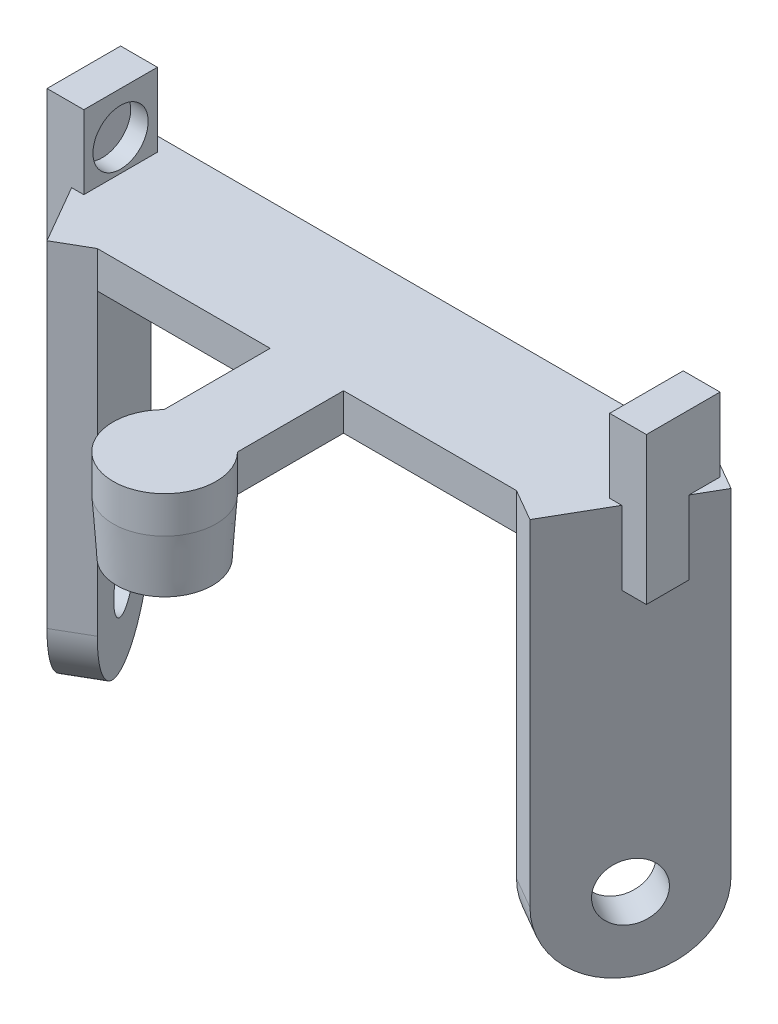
ISO-10303-21;
HEADER;
FILE_DESCRIPTION(('STEP AP214'),'2;1');
FILE_NAME('part.step','',(''),(''),'','','');
FILE_SCHEMA(('AUTOMOTIVE_DESIGN { 1 0 10303 214 1 1 1 1 }'));
ENDSEC;
DATA;
#1=APPLICATION_CONTEXT('core data for automotive mechanical design processes');
#2=APPLICATION_PROTOCOL_DEFINITION('international standard','automotive_design',2000,#1);
#3=PRODUCT_CONTEXT('',#1,'mechanical');
#4=PRODUCT('Part','Part','',(#3));
#5=PRODUCT_RELATED_PRODUCT_CATEGORY('part','',(#4));
#6=PRODUCT_DEFINITION_FORMATION('','',#4);
#7=PRODUCT_DEFINITION_CONTEXT('part definition',#1,'design');
#8=PRODUCT_DEFINITION('design','',#6,#7);
#9=PRODUCT_DEFINITION_SHAPE('','',#8);
#10=(LENGTH_UNIT() NAMED_UNIT(*) SI_UNIT(.MILLI.,.METRE.));
#11=(NAMED_UNIT(*) PLANE_ANGLE_UNIT() SI_UNIT($,.RADIAN.));
#12=(NAMED_UNIT(*) SI_UNIT($,.STERADIAN.) SOLID_ANGLE_UNIT());
#13=UNCERTAINTY_MEASURE_WITH_UNIT(LENGTH_MEASURE(1.E-05),#10,'distance_accuracy_value','');
#14=(GEOMETRIC_REPRESENTATION_CONTEXT(3) GLOBAL_UNCERTAINTY_ASSIGNED_CONTEXT((#13)) GLOBAL_UNIT_ASSIGNED_CONTEXT((#10,
#11,#12)) REPRESENTATION_CONTEXT('',''));
#15=CARTESIAN_POINT('',(0.,0.,0.));
#16=DIRECTION('',(0.,0.,1.));
#17=DIRECTION('',(1.,0.,0.));
#18=AXIS2_PLACEMENT_3D('',#15,#16,#17);
#19=CARTESIAN_POINT('',(0.,18.25,-12.));
#20=DIRECTION('',(0.,-1.,0.));
#21=DIRECTION('',(0.,0.,-1.));
#22=AXIS2_PLACEMENT_3D('',#19,#20,#21);
#23=PLANE('',#22);
#24=DIRECTION('',(0.,0.,1.));
#25=VECTOR('',#24,1.);
#26=CARTESIAN_POINT('',(-14.2889225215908,18.25,-12.));
#27=LINE('',#26,#25);
#28=CARTESIAN_POINT('',(-14.2889225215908,18.25,-25.8964867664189));
#29=VERTEX_POINT('',#28);
#30=CARTESIAN_POINT('',(-14.2889225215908,18.25,-21.8975380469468));
#31=VERTEX_POINT('',#30);
#32=EDGE_CURVE('E374',#29,#31,#27,.T.);
#33=ORIENTED_EDGE('',*,*,#32,.T.);
#34=DIRECTION('',(-1.,0.,0.));
#35=VECTOR('',#34,1.);
#36=CARTESIAN_POINT('',(0.,18.25,-21.8975380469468));
#37=LINE('',#36,#35);
#38=CARTESIAN_POINT('',(-14.9519505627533,18.25,-21.8975380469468));
#39=VERTEX_POINT('',#38);
#40=EDGE_CURVE('E407',#31,#39,#37,.T.);
#41=ORIENTED_EDGE('',*,*,#40,.T.);
#42=DIRECTION('',(0.500000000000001,0.,0.866025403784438));
#43=VECTOR('',#42,1.);
#44=CARTESIAN_POINT('',(-13.1235508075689,18.25,-18.7306567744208));
#45=LINE('',#44,#43);
#46=CARTESIAN_POINT('',(-13.1235508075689,18.25,-18.7306567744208));
#47=VERTEX_POINT('',#46);
#48=EDGE_CURVE('E460',#39,#47,#45,.T.);
#49=ORIENTED_EDGE('',*,*,#48,.T.);
#50=DIRECTION('',(0.866025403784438,0.,-0.500000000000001));
#51=VECTOR('',#50,1.);
#52=CARTESIAN_POINT('',(-11.3915,18.25,-19.7306567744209));
#53=LINE('',#52,#51);
#54=CARTESIAN_POINT('',(-11.3915,18.25,-19.7306567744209));
#55=VERTEX_POINT('',#54);
#56=EDGE_CURVE('E459',#47,#55,#53,.T.);
#57=ORIENTED_EDGE('',*,*,#56,.T.);
#58=DIRECTION('',(1.,0.,0.));
#59=VECTOR('',#58,1.);
#60=CARTESIAN_POINT('',(-11.3915,18.25,-19.7306567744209));
#61=LINE('',#60,#59);
#62=CARTESIAN_POINT('',(-1.99408198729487,18.25,-19.7306567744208));
#63=VERTEX_POINT('',#62);
#64=EDGE_CURVE('E463',#55,#63,#61,.T.);
#65=ORIENTED_EDGE('',*,*,#64,.T.);
#66=DIRECTION('',(0.,0.,1.));
#67=VECTOR('',#66,1.);
#68=CARTESIAN_POINT('',(-1.99408198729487,18.25,-13.96561365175));
#69=LINE('',#68,#67);
#70=CARTESIAN_POINT('',(-1.99408198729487,18.25,-13.96561365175));
#71=VERTEX_POINT('',#70);
#72=EDGE_CURVE('E466',#63,#71,#69,.T.);
#73=ORIENTED_EDGE('',*,*,#72,.T.);
#74=CARTESIAN_POINT('',(0.,18.25,-12.));
#75=DIRECTION('',(0.,1.,0.));
#76=DIRECTION('',(0.,0.,-1.));
#77=AXIS2_PLACEMENT_3D('',#74,#75,#76);
#78=CIRCLE('',#77,2.8);
#79=CARTESIAN_POINT('',(1.99408198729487,18.25,-13.96561365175));
#80=VERTEX_POINT('',#79);
#81=EDGE_CURVE('E469',#71,#80,#78,.T.);
#82=ORIENTED_EDGE('',*,*,#81,.T.);
#83=DIRECTION('',(0.,0.,-1.));
#84=VECTOR('',#83,1.);
#85=CARTESIAN_POINT('',(1.99408198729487,18.25,-19.7306567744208));
#86=LINE('',#85,#84);
#87=CARTESIAN_POINT('',(1.99408198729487,18.25,-19.7306567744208));
#88=VERTEX_POINT('',#87);
#89=EDGE_CURVE('E472',#80,#88,#86,.T.);
#90=ORIENTED_EDGE('',*,*,#89,.T.);
#91=DIRECTION('',(1.,0.,0.));
#92=VECTOR('',#91,1.);
#93=CARTESIAN_POINT('',(1.99408198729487,18.25,-19.7306567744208));
#94=LINE('',#93,#92);
#95=CARTESIAN_POINT('',(11.3915,18.25,-19.7306567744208));
#96=VERTEX_POINT('',#95);
#97=EDGE_CURVE('E475',#88,#96,#94,.T.);
#98=ORIENTED_EDGE('',*,*,#97,.T.);
#99=DIRECTION('',(0.866025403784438,0.,0.500000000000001));
#100=VECTOR('',#99,1.);
#101=CARTESIAN_POINT('',(13.1235508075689,18.25,-18.7306567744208));
#102=LINE('',#101,#100);
#103=CARTESIAN_POINT('',(13.1235508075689,18.25,-18.7306567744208));
#104=VERTEX_POINT('',#103);
#105=EDGE_CURVE('E478',#96,#104,#102,.T.);
#106=ORIENTED_EDGE('',*,*,#105,.T.);
#107=DIRECTION('',(0.500000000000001,0.,-0.866025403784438));
#108=VECTOR('',#107,1.);
#109=CARTESIAN_POINT('',(17.1235508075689,18.25,-25.6588600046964));
#110=LINE('',#109,#108);
#111=CARTESIAN_POINT('',(14.9519505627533,18.25,-21.8975380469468));
#112=VERTEX_POINT('',#111);
#113=EDGE_CURVE('E483',#104,#112,#110,.T.);
#114=ORIENTED_EDGE('',*,*,#113,.T.);
#115=DIRECTION('',(1.,0.,0.));
#116=VECTOR('',#115,1.);
#117=CARTESIAN_POINT('',(0.,18.25,-21.8975380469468));
#118=LINE('',#117,#116);
#119=CARTESIAN_POINT('',(14.2889225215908,18.25,-21.8975380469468));
#120=VERTEX_POINT('',#119);
#121=EDGE_CURVE('E330',#120,#112,#118,.T.);
#122=ORIENTED_EDGE('',*,*,#121,.F.);
#123=DIRECTION('',(0.,0.,1.));
#124=VECTOR('',#123,1.);
#125=CARTESIAN_POINT('',(14.2889225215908,18.25,-12.));
#126=LINE('',#125,#124);
#127=CARTESIAN_POINT('',(14.2889225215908,18.25,-25.8964867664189));
#128=VERTEX_POINT('',#127);
#129=EDGE_CURVE('E258',#128,#120,#126,.T.);
#130=ORIENTED_EDGE('',*,*,#129,.F.);
#131=DIRECTION('',(-1.,0.,0.));
#132=VECTOR('',#131,1.);
#133=CARTESIAN_POINT('',(0.,18.25,-25.8964867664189));
#134=LINE('',#133,#132);
#135=CARTESIAN_POINT('',(16.2869427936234,18.25,-25.8964867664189));
#136=VERTEX_POINT('',#135);
#137=EDGE_CURVE('E324',#136,#128,#134,.T.);
#138=ORIENTED_EDGE('',*,*,#137,.F.);
#139=DIRECTION('',(0.,0.,-1.));
#140=VECTOR('',#139,1.);
#141=CARTESIAN_POINT('',(16.2869427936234,18.25,-12.));
#142=LINE('',#141,#140);
#143=CARTESIAN_POINT('',(16.2869427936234,18.25,-24.2098124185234));
#144=VERTEX_POINT('',#143);
#145=EDGE_CURVE('E333',#144,#136,#142,.T.);
#146=ORIENTED_EDGE('',*,*,#145,.F.);
#147=CARTESIAN_POINT('',(17.1235508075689,18.25,-25.6588600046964));
#148=VERTEX_POINT('',#147);
#149=EDGE_CURVE('E482',#144,#148,#110,.T.);
#150=ORIENTED_EDGE('',*,*,#149,.T.);
#151=DIRECTION('',(-0.866025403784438,0.,-0.5));
#152=VECTOR('',#151,1.);
#153=CARTESIAN_POINT('',(15.3915,18.25,-26.6588600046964));
#154=LINE('',#153,#152);
#155=CARTESIAN_POINT('',(15.3915,18.25,-26.6588600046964));
#156=VERTEX_POINT('',#155);
#157=EDGE_CURVE('E486',#148,#156,#154,.T.);
#158=ORIENTED_EDGE('',*,*,#157,.T.);
#159=DIRECTION('',(-1.,0.,0.));
#160=VECTOR('',#159,1.);
#161=CARTESIAN_POINT('',(-15.3915,18.25,-26.6588600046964));
#162=LINE('',#161,#160);
#163=CARTESIAN_POINT('',(-15.3915,18.25,-26.6588600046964));
#164=VERTEX_POINT('',#163);
#165=EDGE_CURVE('E489',#156,#164,#162,.T.);
#166=ORIENTED_EDGE('',*,*,#165,.T.);
#167=DIRECTION('',(-0.866025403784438,0.,0.5));
#168=VECTOR('',#167,1.);
#169=CARTESIAN_POINT('',(-17.1235508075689,18.25,-25.6588600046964));
#170=LINE('',#169,#168);
#171=CARTESIAN_POINT('',(-17.1235508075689,18.25,-25.6588600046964));
#172=VERTEX_POINT('',#171);
#173=EDGE_CURVE('E492',#164,#172,#170,.T.);
#174=ORIENTED_EDGE('',*,*,#173,.T.);
#175=CARTESIAN_POINT('',(-16.2869427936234,18.25,-24.2098124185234));
#176=VERTEX_POINT('',#175);
#177=EDGE_CURVE('E455',#172,#176,#45,.T.);
#178=ORIENTED_EDGE('',*,*,#177,.T.);
#179=DIRECTION('',(0.,0.,-1.));
#180=VECTOR('',#179,1.);
#181=CARTESIAN_POINT('',(-16.2869427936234,18.25,-12.));
#182=LINE('',#181,#180);
#183=CARTESIAN_POINT('',(-16.2869427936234,18.25,-25.8964867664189));
#184=VERTEX_POINT('',#183);
#185=EDGE_CURVE('E403',#176,#184,#182,.T.);
#186=ORIENTED_EDGE('',*,*,#185,.T.);
#187=DIRECTION('',(1.,0.,0.));
#188=VECTOR('',#187,1.);
#189=CARTESIAN_POINT('',(0.,18.25,-25.8964867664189));
#190=LINE('',#189,#188);
#191=EDGE_CURVE('E399',#184,#29,#190,.T.);
#192=ORIENTED_EDGE('',*,*,#191,.T.);
#193=EDGE_LOOP('',(#33,#41,#49,#57,#65,#73,#82,#90,#98,#106,#114,#122,#130,#138,#146,#150,#158,
#166,#174,#178,#186,#192));
#194=FACE_BOUND('',#193,.T.);
#195=ADVANCED_FACE('F39',(#194),#23,.F.);
#196=CARTESIAN_POINT('',(15.1235508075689,0.,-22.1947583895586));
#197=DIRECTION('',(-0.866025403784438,0.,-0.500000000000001));
#198=DIRECTION('',(-0.500000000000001,0.,0.866025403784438));
#199=AXIS2_PLACEMENT_3D('',#196,#197,#198);
#200=PLANE('',#199);
#201=CARTESIAN_POINT('',(15.1235508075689,0.,-22.1947583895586));
#202=DIRECTION('',(-0.866025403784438,0.,-0.500000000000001));
#203=DIRECTION('',(-0.500000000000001,0.,0.866025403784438));
#204=AXIS2_PLACEMENT_3D('',#201,#202,#203);
#205=CIRCLE('',#204,1.55);
#206=CARTESIAN_POINT('',(14.3485508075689,0.,-20.8524190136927));
#207=VERTEX_POINT('',#206);
#208=EDGE_CURVE('E555',#207,#207,#205,.T.);
#209=ORIENTED_EDGE('',*,*,#208,.T.);
#210=EDGE_LOOP('',(#209));
#211=FACE_BOUND('',#210,.T.);
#212=DIRECTION('',(0.,1.,0.));
#213=VECTOR('',#212,1.);
#214=CARTESIAN_POINT('',(16.2869427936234,0.,-24.2098124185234));
#215=LINE('',#214,#213);
#216=CARTESIAN_POINT('',(16.2869427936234,14.25,-24.2098124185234));
#217=VERTEX_POINT('',#216);
#218=EDGE_CURVE('E11',#217,#144,#215,.T.);
#219=ORIENTED_EDGE('',*,*,#218,.F.);
#220=DIRECTION('',(0.500000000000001,0.,-0.866025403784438));
#221=VECTOR('',#220,1.);
#222=CARTESIAN_POINT('',(15.1235508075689,14.25,-22.1947583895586));
#223=LINE('',#222,#221);
#224=CARTESIAN_POINT('',(14.9519505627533,14.25,-21.8975380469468));
#225=VERTEX_POINT('',#224);
#226=EDGE_CURVE('E327',#225,#217,#223,.T.);
#227=ORIENTED_EDGE('',*,*,#226,.F.);
#228=DIRECTION('',(0.,-1.,0.));
#229=VECTOR('',#228,1.);
#230=CARTESIAN_POINT('',(14.9519505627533,0.,-21.8975380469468));
#231=LINE('',#230,#229);
#232=EDGE_CURVE('E49',#112,#225,#231,.T.);
#233=ORIENTED_EDGE('',*,*,#232,.F.);
#234=ORIENTED_EDGE('',*,*,#113,.F.);
#235=DIRECTION('',(0.,-1.,0.));
#236=VECTOR('',#235,1.);
#237=CARTESIAN_POINT('',(13.1235508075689,0.,-18.7306567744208));
#238=LINE('',#237,#236);
#239=CARTESIAN_POINT('',(13.1235508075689,0.,-18.7306567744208));
#240=VERTEX_POINT('',#239);
#241=EDGE_CURVE('E572',#104,#240,#238,.T.);
#242=ORIENTED_EDGE('',*,*,#241,.T.);
#243=CARTESIAN_POINT('',(15.1235508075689,0.,-22.1947583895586));
#244=DIRECTION('',(0.866025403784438,0.,0.500000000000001));
#245=DIRECTION('',(-0.500000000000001,0.,0.866025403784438));
#246=AXIS2_PLACEMENT_3D('',#243,#244,#245);
#247=CIRCLE('',#246,4.);
#248=CARTESIAN_POINT('',(17.1235508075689,0.,-25.6588600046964));
#249=VERTEX_POINT('',#248);
#250=EDGE_CURVE('E563',#240,#249,#247,.T.);
#251=ORIENTED_EDGE('',*,*,#250,.T.);
#252=DIRECTION('',(0.,1.,0.));
#253=VECTOR('',#252,1.);
#254=CARTESIAN_POINT('',(17.1235508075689,16.25,-25.6588600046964));
#255=LINE('',#254,#253);
#256=EDGE_CURVE('E567',#249,#148,#255,.T.);
#257=ORIENTED_EDGE('',*,*,#256,.T.);
#258=ORIENTED_EDGE('',*,*,#149,.F.);
#259=EDGE_LOOP('',(#219,#227,#233,#234,#242,#251,#257,#258));
#260=FACE_BOUND('',#259,.T.);
#261=ADVANCED_FACE('F631',(#211,#260),#200,.F.);
#262=CARTESIAN_POINT('',(13.3915,0.,-23.1947583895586));
#263=DIRECTION('',(-0.866025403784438,0.,-0.500000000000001));
#264=DIRECTION('',(-0.500000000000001,0.,0.866025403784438));
#265=AXIS2_PLACEMENT_3D('',#262,#263,#264);
#266=PLANE('',#265);
#267=CARTESIAN_POINT('',(13.3915,0.,-23.1947583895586));
#268=DIRECTION('',(-0.866025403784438,0.,-0.500000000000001));
#269=DIRECTION('',(-0.500000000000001,0.,0.866025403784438));
#270=AXIS2_PLACEMENT_3D('',#267,#268,#269);
#271=CIRCLE('',#270,1.55);
#272=CARTESIAN_POINT('',(12.6165,0.,-21.8524190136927));
#273=VERTEX_POINT('',#272);
#274=EDGE_CURVE('E554',#273,#273,#271,.T.);
#275=ORIENTED_EDGE('',*,*,#274,.F.);
#276=EDGE_LOOP('',(#275));
#277=FACE_BOUND('',#276,.T.);
#278=DIRECTION('',(-0.500000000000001,0.,0.866025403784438));
#279=VECTOR('',#278,1.);
#280=CARTESIAN_POINT('',(11.3915,16.25,-19.7306567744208));
#281=LINE('',#280,#279);
#282=CARTESIAN_POINT('',(14.2889225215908,16.25,-24.7491397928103));
#283=VERTEX_POINT('',#282);
#284=CARTESIAN_POINT('',(11.3915,16.25,-19.7306567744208));
#285=VERTEX_POINT('',#284);
#286=EDGE_CURVE('E582',#283,#285,#281,.T.);
#287=ORIENTED_EDGE('',*,*,#286,.F.);
#288=DIRECTION('',(0.,-1.,0.));
#289=VECTOR('',#288,1.);
#290=CARTESIAN_POINT('',(14.2889225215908,0.,-24.7491397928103));
#291=LINE('',#290,#289);
#292=CARTESIAN_POINT('',(14.2889225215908,14.25,-24.7491397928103));
#293=VERTEX_POINT('',#292);
#294=EDGE_CURVE('E316',#283,#293,#291,.T.);
#295=ORIENTED_EDGE('',*,*,#294,.T.);
#296=DIRECTION('',(0.500000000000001,0.,-0.866025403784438));
#297=VECTOR('',#296,1.);
#298=CARTESIAN_POINT('',(13.3915,14.25,-23.1947583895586));
#299=LINE('',#298,#297);
#300=CARTESIAN_POINT('',(14.9513436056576,14.25,-25.8964867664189));
#301=VERTEX_POINT('',#300);
#302=EDGE_CURVE('E618',#293,#301,#299,.T.);
#303=ORIENTED_EDGE('',*,*,#302,.T.);
#304=DIRECTION('',(0.,1.,0.));
#305=VECTOR('',#304,1.);
#306=CARTESIAN_POINT('',(14.9513436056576,0.,-25.8964867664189));
#307=LINE('',#306,#305);
#308=CARTESIAN_POINT('',(14.9513436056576,16.25,-25.8964867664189));
#309=VERTEX_POINT('',#308);
#310=EDGE_CURVE('E320',#301,#309,#307,.T.);
#311=ORIENTED_EDGE('',*,*,#310,.T.);
#312=CARTESIAN_POINT('',(15.3915,16.25,-26.6588600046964));
#313=VERTEX_POINT('',#312);
#314=EDGE_CURVE('E583',#313,#309,#281,.T.);
#315=ORIENTED_EDGE('',*,*,#314,.F.);
#316=DIRECTION('',(0.,1.,0.));
#317=VECTOR('',#316,1.);
#318=CARTESIAN_POINT('',(15.3915,16.25,-26.6588600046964));
#319=LINE('',#318,#317);
#320=CARTESIAN_POINT('',(15.3915,0.,-26.6588600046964));
#321=VERTEX_POINT('',#320);
#322=EDGE_CURVE('E579',#321,#313,#319,.T.);
#323=ORIENTED_EDGE('',*,*,#322,.F.);
#324=CARTESIAN_POINT('',(13.3915,0.,-23.1947583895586));
#325=DIRECTION('',(0.866025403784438,0.,0.500000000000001));
#326=DIRECTION('',(-0.500000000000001,0.,0.866025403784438));
#327=AXIS2_PLACEMENT_3D('',#324,#325,#326);
#328=CIRCLE('',#327,4.);
#329=CARTESIAN_POINT('',(11.3915,0.,-19.7306567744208));
#330=VERTEX_POINT('',#329);
#331=EDGE_CURVE('E559',#330,#321,#328,.T.);
#332=ORIENTED_EDGE('',*,*,#331,.F.);
#333=DIRECTION('',(0.,-1.,0.));
#334=VECTOR('',#333,1.);
#335=CARTESIAN_POINT('',(11.3915,0.,-19.7306567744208));
#336=LINE('',#335,#334);
#337=EDGE_CURVE('E568',#285,#330,#336,.T.);
#338=ORIENTED_EDGE('',*,*,#337,.F.);
#339=EDGE_LOOP('',(#287,#295,#303,#311,#315,#323,#332,#338));
#340=FACE_BOUND('',#339,.T.);
#341=ADVANCED_FACE('F654',(#277,#340),#266,.T.);
#342=CARTESIAN_POINT('',(0.,16.25,-12.));
#343=DIRECTION('',(0.,-1.,0.));
#344=DIRECTION('',(0.,0.,-1.));
#345=AXIS2_PLACEMENT_3D('',#342,#343,#344);
#346=PLANE('',#345);
#347=DIRECTION('',(-1.,0.,0.));
#348=VECTOR('',#347,1.);
#349=CARTESIAN_POINT('',(0.,16.25,-25.8964867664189));
#350=LINE('',#349,#348);
#351=CARTESIAN_POINT('',(14.2889225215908,16.25,-25.8964867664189));
#352=VERTEX_POINT('',#351);
#353=EDGE_CURVE('E611',#309,#352,#350,.T.);
#354=ORIENTED_EDGE('',*,*,#353,.T.);
#355=DIRECTION('',(0.,0.,1.));
#356=VECTOR('',#355,1.);
#357=CARTESIAN_POINT('',(14.2889225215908,16.25,-12.));
#358=LINE('',#357,#356);
#359=EDGE_CURVE('E312',#352,#283,#358,.T.);
#360=ORIENTED_EDGE('',*,*,#359,.T.);
#361=ORIENTED_EDGE('',*,*,#286,.T.);
#362=DIRECTION('',(1.,0.,0.));
#363=VECTOR('',#362,1.);
#364=CARTESIAN_POINT('',(1.99408198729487,16.25,-19.7306567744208));
#365=LINE('',#364,#363);
#366=CARTESIAN_POINT('',(1.99408198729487,16.25,-19.7306567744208));
#367=VERTEX_POINT('',#366);
#368=EDGE_CURVE('E509',#367,#285,#365,.T.);
#369=ORIENTED_EDGE('',*,*,#368,.F.);
#370=DIRECTION('',(0.,0.,-1.));
#371=VECTOR('',#370,1.);
#372=CARTESIAN_POINT('',(1.99408198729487,16.25,-19.7306567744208));
#373=LINE('',#372,#371);
#374=CARTESIAN_POINT('',(1.99408198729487,16.25,-13.96561365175));
#375=VERTEX_POINT('',#374);
#376=EDGE_CURVE('E506',#375,#367,#373,.T.);
#377=ORIENTED_EDGE('',*,*,#376,.F.);
#378=CARTESIAN_POINT('',(0.,16.25,-12.));
#379=DIRECTION('',(0.,1.,0.));
#380=DIRECTION('',(0.,0.,1.));
#381=AXIS2_PLACEMENT_3D('',#378,#379,#380);
#382=CIRCLE('',#381,2.8);
#383=CARTESIAN_POINT('',(-1.99408198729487,16.25,-13.96561365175));
#384=VERTEX_POINT('',#383);
#385=EDGE_CURVE('E415',#375,#384,#382,.T.);
#386=ORIENTED_EDGE('',*,*,#385,.T.);
#387=DIRECTION('',(0.,0.,1.));
#388=VECTOR('',#387,1.);
#389=CARTESIAN_POINT('',(-1.99408198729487,16.25,-13.96561365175));
#390=LINE('',#389,#388);
#391=CARTESIAN_POINT('',(-1.99408198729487,16.25,-19.7306567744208));
#392=VERTEX_POINT('',#391);
#393=EDGE_CURVE('E498',#392,#384,#390,.T.);
#394=ORIENTED_EDGE('',*,*,#393,.F.);
#395=DIRECTION('',(1.,0.,0.));
#396=VECTOR('',#395,1.);
#397=CARTESIAN_POINT('',(-11.3915,16.25,-19.7306567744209));
#398=LINE('',#397,#396);
#399=CARTESIAN_POINT('',(-11.3915,16.25,-19.7306567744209));
#400=VERTEX_POINT('',#399);
#401=EDGE_CURVE('E454',#400,#392,#398,.T.);
#402=ORIENTED_EDGE('',*,*,#401,.F.);
#403=DIRECTION('',(-0.500000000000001,0.,-0.866025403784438));
#404=VECTOR('',#403,1.);
#405=CARTESIAN_POINT('',(-15.3915,16.25,-26.6588600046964));
#406=LINE('',#405,#404);
#407=CARTESIAN_POINT('',(-14.2889225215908,16.25,-24.7491397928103));
#408=VERTEX_POINT('',#407);
#409=EDGE_CURVE('E441',#400,#408,#406,.T.);
#410=ORIENTED_EDGE('',*,*,#409,.T.);
#411=DIRECTION('',(0.,0.,1.));
#412=VECTOR('',#411,1.);
#413=CARTESIAN_POINT('',(-14.2889225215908,16.25,-12.));
#414=LINE('',#413,#412);
#415=CARTESIAN_POINT('',(-14.2889225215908,16.25,-25.8964867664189));
#416=VERTEX_POINT('',#415);
#417=EDGE_CURVE('E390',#416,#408,#414,.T.);
#418=ORIENTED_EDGE('',*,*,#417,.F.);
#419=DIRECTION('',(1.,0.,0.));
#420=VECTOR('',#419,1.);
#421=CARTESIAN_POINT('',(0.,16.25,-25.8964867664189));
#422=LINE('',#421,#420);
#423=CARTESIAN_POINT('',(-14.9513436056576,16.25,-25.8964867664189));
#424=VERTEX_POINT('',#423);
#425=EDGE_CURVE('E396',#424,#416,#422,.T.);
#426=ORIENTED_EDGE('',*,*,#425,.F.);
#427=CARTESIAN_POINT('',(-15.3915,16.25,-26.6588600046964));
#428=VERTEX_POINT('',#427);
#429=EDGE_CURVE('E440',#424,#428,#406,.T.);
#430=ORIENTED_EDGE('',*,*,#429,.T.);
#431=DIRECTION('',(-1.,0.,0.));
#432=VECTOR('',#431,1.);
#433=CARTESIAN_POINT('',(-15.3915,16.25,-26.6588600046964));
#434=LINE('',#433,#432);
#435=EDGE_CURVE('E513',#313,#428,#434,.T.);
#436=ORIENTED_EDGE('',*,*,#435,.F.);
#437=ORIENTED_EDGE('',*,*,#314,.T.);
#438=EDGE_LOOP('',(#354,#360,#361,#369,#377,#386,#394,#402,#410,#418,#426,#430,#436,#437));
#439=FACE_BOUND('',#438,.T.);
#440=ADVANCED_FACE('F651',(#439),#346,.T.);
#441=CARTESIAN_POINT('',(-14.2889225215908,14.25,-23.8947583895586));
#442=DIRECTION('',(1.,0.,0.));
#443=DIRECTION('',(0.,0.,-1.));
#444=AXIS2_PLACEMENT_3D('',#441,#442,#443);
#445=PLANE('',#444);
#446=DIRECTION('',(0.,1.,0.));
#447=VECTOR('',#446,1.);
#448=CARTESIAN_POINT('',(-14.2889225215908,14.25,-21.8975380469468));
#449=LINE('',#448,#447);
#450=CARTESIAN_POINT('',(-14.2889225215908,22.25,-21.8975380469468));
#451=VERTEX_POINT('',#450);
#452=EDGE_CURVE('E371',#31,#451,#449,.T.);
#453=ORIENTED_EDGE('',*,*,#452,.F.);
#454=ORIENTED_EDGE('',*,*,#32,.F.);
#455=DIRECTION('',(0.,1.,0.));
#456=VECTOR('',#455,1.);
#457=CARTESIAN_POINT('',(-14.2889225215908,14.25,-25.8964867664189));
#458=LINE('',#457,#456);
#459=CARTESIAN_POINT('',(-14.2889225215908,22.25,-25.8964867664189));
#460=VERTEX_POINT('',#459);
#461=EDGE_CURVE('E370',#29,#460,#458,.T.);
#462=ORIENTED_EDGE('',*,*,#461,.T.);
#463=DIRECTION('',(0.,0.,-1.));
#464=VECTOR('',#463,1.);
#465=CARTESIAN_POINT('',(-14.2889225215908,22.25,-21.8975380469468));
#466=LINE('',#465,#464);
#467=EDGE_CURVE('E341',#451,#460,#466,.T.);
#468=ORIENTED_EDGE('',*,*,#467,.F.);
#469=EDGE_LOOP('',(#453,#454,#462,#468));
#470=FACE_BOUND('',#469,.T.);
#471=CARTESIAN_POINT('',(-14.2889225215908,19.9551715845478,-23.8947583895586));
#472=DIRECTION('',(1.,0.,0.));
#473=DIRECTION('',(0.,-1.,0.));
#474=AXIS2_PLACEMENT_3D('',#471,#472,#473);
#475=ELLIPSE('',#474,1.50091431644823,1.5);
#476=CARTESIAN_POINT('',(-14.2889225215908,18.4542572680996,-23.8947583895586));
#477=VERTEX_POINT('',#476);
#478=EDGE_CURVE('E340',#477,#477,#475,.F.);
#479=ORIENTED_EDGE('',*,*,#478,.T.);
#480=EDGE_LOOP('',(#479));
#481=FACE_BOUND('',#480,.T.);
#482=ADVANCED_FACE('F705',(#470,#481),#445,.T.);
#483=CARTESIAN_POINT('',(15.1235508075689,0.,-22.1947583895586));
#484=DIRECTION('',(-0.866025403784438,0.,-0.500000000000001));
#485=DIRECTION('',(-0.500000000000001,0.,0.866025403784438));
#486=AXIS2_PLACEMENT_3D('',#483,#484,#485);
#487=CYLINDRICAL_SURFACE('',#486,4.);
#488=ORIENTED_EDGE('',*,*,#331,.T.);
#489=DIRECTION('',(-0.866025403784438,0.,-0.500000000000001));
#490=VECTOR('',#489,1.);
#491=CARTESIAN_POINT('',(17.1235508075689,0.,-25.6588600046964));
#492=LINE('',#491,#490);
#493=EDGE_CURVE('E592',#249,#321,#492,.T.);
#494=ORIENTED_EDGE('',*,*,#493,.F.);
#495=ORIENTED_EDGE('',*,*,#250,.F.);
#496=DIRECTION('',(-0.866025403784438,0.,-0.500000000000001));
#497=VECTOR('',#496,1.);
#498=CARTESIAN_POINT('',(13.1235508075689,0.,-18.7306567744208));
#499=LINE('',#498,#497);
#500=EDGE_CURVE('E575',#240,#330,#499,.T.);
#501=ORIENTED_EDGE('',*,*,#500,.T.);
#502=EDGE_LOOP('',(#488,#494,#495,#501));
#503=FACE_BOUND('',#502,.T.);
#504=ADVANCED_FACE('F41',(#503),#487,.T.);
#505=CARTESIAN_POINT('',(17.1235508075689,16.25,-25.6588600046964));
#506=DIRECTION('',(-0.500000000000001,0.,0.866025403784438));
#507=DIRECTION('',(0.866025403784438,0.,0.500000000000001));
#508=AXIS2_PLACEMENT_3D('',#505,#506,#507);
#509=PLANE('',#508);
#510=ORIENTED_EDGE('',*,*,#322,.T.);
#511=DIRECTION('',(0.,-1.,0.));
#512=VECTOR('',#511,1.);
#513=CARTESIAN_POINT('',(15.3915,18.25,-26.6588600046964));
#514=LINE('',#513,#512);
#515=EDGE_CURVE('E523',#156,#313,#514,.T.);
#516=ORIENTED_EDGE('',*,*,#515,.F.);
#517=ORIENTED_EDGE('',*,*,#157,.F.);
#518=ORIENTED_EDGE('',*,*,#256,.F.);
#519=ORIENTED_EDGE('',*,*,#493,.T.);
#520=EDGE_LOOP('',(#510,#516,#517,#518,#519));
#521=FACE_BOUND('',#520,.T.);
#522=ADVANCED_FACE('F668',(#521),#509,.F.);
#523=CARTESIAN_POINT('',(13.1235508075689,0.,-18.7306567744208));
#524=DIRECTION('',(0.500000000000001,0.,-0.866025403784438));
#525=DIRECTION('',(-0.866025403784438,0.,-0.500000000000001));
#526=AXIS2_PLACEMENT_3D('',#523,#524,#525);
#527=PLANE('',#526);
#528=ORIENTED_EDGE('',*,*,#337,.T.);
#529=ORIENTED_EDGE('',*,*,#500,.F.);
#530=ORIENTED_EDGE('',*,*,#241,.F.);
#531=ORIENTED_EDGE('',*,*,#105,.F.);
#532=DIRECTION('',(0.,-1.,0.));
#533=VECTOR('',#532,1.);
#534=CARTESIAN_POINT('',(11.3915,18.25,-19.7306567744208));
#535=LINE('',#534,#533);
#536=EDGE_CURVE('E527',#96,#285,#535,.T.);
#537=ORIENTED_EDGE('',*,*,#536,.T.);
#538=EDGE_LOOP('',(#528,#529,#530,#531,#537));
#539=FACE_BOUND('',#538,.T.);
#540=ADVANCED_FACE('F663',(#539),#527,.F.);
#541=CARTESIAN_POINT('',(15.1235508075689,0.,-22.1947583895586));
#542=DIRECTION('',(-0.866025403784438,0.,-0.500000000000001));
#543=DIRECTION('',(-0.500000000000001,0.,0.866025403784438));
#544=AXIS2_PLACEMENT_3D('',#541,#542,#543);
#545=CYLINDRICAL_SURFACE('',#544,1.55);
#546=ORIENTED_EDGE('',*,*,#208,.F.);
#547=EDGE_LOOP('',(#546));
#548=FACE_BOUND('',#547,.T.);
#549=ORIENTED_EDGE('',*,*,#274,.T.);
#550=EDGE_LOOP('',(#549));
#551=FACE_BOUND('',#550,.T.);
#552=ADVANCED_FACE('F783',(#548,#551),#545,.F.);
#553=CARTESIAN_POINT('',(-13.1235508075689,18.25,-18.7306567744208));
#554=DIRECTION('',(0.866025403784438,0.,-0.500000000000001));
#555=DIRECTION('',(-0.500000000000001,0.,-0.866025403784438));
#556=AXIS2_PLACEMENT_3D('',#553,#554,#555);
#557=PLANE('',#556);
#558=ORIENTED_EDGE('',*,*,#48,.F.);
#559=DIRECTION('',(0.,-1.,0.));
#560=VECTOR('',#559,1.);
#561=CARTESIAN_POINT('',(-14.9519505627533,18.25,-21.8975380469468));
#562=LINE('',#561,#560);
#563=CARTESIAN_POINT('',(-14.9519505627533,14.25,-21.8975380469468));
#564=VERTEX_POINT('',#563);
#565=EDGE_CURVE('E607',#39,#564,#562,.T.);
#566=ORIENTED_EDGE('',*,*,#565,.T.);
#567=DIRECTION('',(0.500000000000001,0.,0.866025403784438));
#568=VECTOR('',#567,1.);
#569=CARTESIAN_POINT('',(-13.1235508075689,14.25,-18.7306567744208));
#570=LINE('',#569,#568);
#571=CARTESIAN_POINT('',(-16.2869427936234,14.25,-24.2098124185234));
#572=VERTEX_POINT('',#571);
#573=EDGE_CURVE('E393',#572,#564,#570,.T.);
#574=ORIENTED_EDGE('',*,*,#573,.F.);
#575=DIRECTION('',(0.,1.,0.));
#576=VECTOR('',#575,1.);
#577=CARTESIAN_POINT('',(-16.2869427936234,18.25,-24.2098124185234));
#578=LINE('',#577,#576);
#579=EDGE_CURVE('E603',#572,#176,#578,.T.);
#580=ORIENTED_EDGE('',*,*,#579,.T.);
#581=ORIENTED_EDGE('',*,*,#177,.F.);
#582=DIRECTION('',(0.,-1.,0.));
#583=VECTOR('',#582,1.);
#584=CARTESIAN_POINT('',(-17.1235508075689,18.25,-25.6588600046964));
#585=LINE('',#584,#583);
#586=CARTESIAN_POINT('',(-17.1235508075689,0.,-25.6588600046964));
#587=VERTEX_POINT('',#586);
#588=EDGE_CURVE('E495',#172,#587,#585,.T.);
#589=ORIENTED_EDGE('',*,*,#588,.T.);
#590=CARTESIAN_POINT('',(-15.1235508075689,0.,-22.1947583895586));
#591=DIRECTION('',(-0.866025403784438,0.,0.500000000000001));
#592=DIRECTION('',(-0.500000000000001,0.,-0.866025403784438));
#593=AXIS2_PLACEMENT_3D('',#590,#591,#592);
#594=CIRCLE('',#593,4.);
#595=CARTESIAN_POINT('',(-13.1235508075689,0.,-18.7306567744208));
#596=VERTEX_POINT('',#595);
#597=EDGE_CURVE('E427',#587,#596,#594,.T.);
#598=ORIENTED_EDGE('',*,*,#597,.T.);
#599=DIRECTION('',(0.,-1.,0.));
#600=VECTOR('',#599,1.);
#601=CARTESIAN_POINT('',(-13.1235508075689,18.25,-18.7306567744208));
#602=LINE('',#601,#600);
#603=EDGE_CURVE('E551',#47,#596,#602,.T.);
#604=ORIENTED_EDGE('',*,*,#603,.F.);
#605=EDGE_LOOP('',(#558,#566,#574,#580,#581,#589,#598,#604));
#606=FACE_BOUND('',#605,.T.);
#607=CARTESIAN_POINT('',(-15.1235508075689,0.,-22.1947583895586));
#608=DIRECTION('',(0.866025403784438,0.,-0.500000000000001));
#609=DIRECTION('',(-0.500000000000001,0.,-0.866025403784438));
#610=AXIS2_PLACEMENT_3D('',#607,#608,#609);
#611=CIRCLE('',#610,1.55);
#612=CARTESIAN_POINT('',(-15.8985508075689,0.,-23.5370977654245));
#613=VERTEX_POINT('',#612);
#614=EDGE_CURVE('E419',#613,#613,#611,.T.);
#615=ORIENTED_EDGE('',*,*,#614,.T.);
#616=EDGE_LOOP('',(#615));
#617=FACE_BOUND('',#616,.T.);
#618=ADVANCED_FACE('F687',(#606,#617),#557,.F.);
#619=CARTESIAN_POINT('',(-11.3915,18.25,-19.7306567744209));
#620=DIRECTION('',(-0.500000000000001,0.,-0.866025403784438));
#621=DIRECTION('',(-0.866025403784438,0.,0.500000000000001));
#622=AXIS2_PLACEMENT_3D('',#619,#620,#621);
#623=PLANE('',#622);
#624=ORIENTED_EDGE('',*,*,#603,.T.);
#625=DIRECTION('',(0.866025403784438,0.,-0.500000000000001));
#626=VECTOR('',#625,1.);
#627=CARTESIAN_POINT('',(-13.1235508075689,0.,-18.7306567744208));
#628=LINE('',#627,#626);
#629=CARTESIAN_POINT('',(-11.3915,0.,-19.7306567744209));
#630=VERTEX_POINT('',#629);
#631=EDGE_CURVE('E450',#596,#630,#628,.T.);
#632=ORIENTED_EDGE('',*,*,#631,.T.);
#633=DIRECTION('',(0.,1.,0.));
#634=VECTOR('',#633,1.);
#635=CARTESIAN_POINT('',(-11.3915,0.,-19.7306567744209));
#636=LINE('',#635,#634);
#637=EDGE_CURVE('E436',#630,#400,#636,.T.);
#638=ORIENTED_EDGE('',*,*,#637,.T.);
#639=DIRECTION('',(0.,-1.,0.));
#640=VECTOR('',#639,1.);
#641=CARTESIAN_POINT('',(-11.3915,18.25,-19.7306567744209));
#642=LINE('',#641,#640);
#643=EDGE_CURVE('E547',#55,#400,#642,.T.);
#644=ORIENTED_EDGE('',*,*,#643,.F.);
#645=ORIENTED_EDGE('',*,*,#56,.F.);
#646=EDGE_LOOP('',(#624,#632,#638,#644,#645));
#647=FACE_BOUND('',#646,.T.);
#648=ADVANCED_FACE('F716',(#647),#623,.F.);
#649=CARTESIAN_POINT('',(-11.3915,18.25,-19.7306567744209));
#650=DIRECTION('',(0.,0.,-1.));
#651=DIRECTION('',(-1.,0.,0.));
#652=AXIS2_PLACEMENT_3D('',#649,#650,#651);
#653=PLANE('',#652);
#654=ORIENTED_EDGE('',*,*,#401,.T.);
#655=DIRECTION('',(0.,-1.,0.));
#656=VECTOR('',#655,1.);
#657=CARTESIAN_POINT('',(-1.99408198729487,18.25,-19.7306567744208));
#658=LINE('',#657,#656);
#659=EDGE_CURVE('E543',#63,#392,#658,.T.);
#660=ORIENTED_EDGE('',*,*,#659,.F.);
#661=ORIENTED_EDGE('',*,*,#64,.F.);
#662=ORIENTED_EDGE('',*,*,#643,.T.);
#663=EDGE_LOOP('',(#654,#660,#661,#662));
#664=FACE_BOUND('',#663,.T.);
#665=ADVANCED_FACE('F721',(#664),#653,.F.);
#666=CARTESIAN_POINT('',(-1.99408198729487,18.25,-13.96561365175));
#667=DIRECTION('',(1.,0.,0.));
#668=DIRECTION('',(0.,0.,-1.));
#669=AXIS2_PLACEMENT_3D('',#666,#667,#668);
#670=PLANE('',#669);
#671=ORIENTED_EDGE('',*,*,#393,.T.);
#672=DIRECTION('',(0.,-1.,0.));
#673=VECTOR('',#672,1.);
#674=CARTESIAN_POINT('',(-1.99408198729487,18.25,-13.96561365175));
#675=LINE('',#674,#673);
#676=EDGE_CURVE('E539',#71,#384,#675,.T.);
#677=ORIENTED_EDGE('',*,*,#676,.F.);
#678=ORIENTED_EDGE('',*,*,#72,.F.);
#679=ORIENTED_EDGE('',*,*,#659,.T.);
#680=EDGE_LOOP('',(#671,#677,#678,#679));
#681=FACE_BOUND('',#680,.T.);
#682=ADVANCED_FACE('F727',(#681),#670,.F.);
#683=CARTESIAN_POINT('',(0.,18.25,-12.));
#684=DIRECTION('',(0.,-1.,0.));
#685=DIRECTION('',(0.,0.,-1.));
#686=AXIS2_PLACEMENT_3D('',#683,#684,#685);
#687=CYLINDRICAL_SURFACE('',#686,2.8);
#688=CARTESIAN_POINT('',(0.,16.25,-12.));
#689=DIRECTION('',(0.,1.,0.));
#690=DIRECTION('',(0.,0.,-1.));
#691=AXIS2_PLACEMENT_3D('',#688,#689,#690);
#692=CIRCLE('',#691,2.8);
#693=EDGE_CURVE('E502',#384,#375,#692,.T.);
#694=ORIENTED_EDGE('',*,*,#693,.T.);
#695=DIRECTION('',(0.,-1.,0.));
#696=VECTOR('',#695,1.);
#697=CARTESIAN_POINT('',(1.99408198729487,18.25,-13.96561365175));
#698=LINE('',#697,#696);
#699=EDGE_CURVE('E535',#80,#375,#698,.T.);
#700=ORIENTED_EDGE('',*,*,#699,.F.);
#701=ORIENTED_EDGE('',*,*,#81,.F.);
#702=ORIENTED_EDGE('',*,*,#676,.T.);
#703=EDGE_LOOP('',(#694,#700,#701,#702));
#704=FACE_BOUND('',#703,.T.);
#705=ADVANCED_FACE('F731',(#704),#687,.T.);
#706=CARTESIAN_POINT('',(1.99408198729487,18.25,-19.7306567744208));
#707=DIRECTION('',(-1.,0.,0.));
#708=DIRECTION('',(0.,0.,1.));
#709=AXIS2_PLACEMENT_3D('',#706,#707,#708);
#710=PLANE('',#709);
#711=ORIENTED_EDGE('',*,*,#376,.T.);
#712=DIRECTION('',(0.,-1.,0.));
#713=VECTOR('',#712,1.);
#714=CARTESIAN_POINT('',(1.99408198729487,18.25,-19.7306567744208));
#715=LINE('',#714,#713);
#716=EDGE_CURVE('E531',#88,#367,#715,.T.);
#717=ORIENTED_EDGE('',*,*,#716,.F.);
#718=ORIENTED_EDGE('',*,*,#89,.F.);
#719=ORIENTED_EDGE('',*,*,#699,.T.);
#720=EDGE_LOOP('',(#711,#717,#718,#719));
#721=FACE_BOUND('',#720,.T.);
#722=ADVANCED_FACE('F735',(#721),#710,.F.);
#723=CARTESIAN_POINT('',(1.99408198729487,18.25,-19.7306567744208));
#724=DIRECTION('',(0.,0.,-1.));
#725=DIRECTION('',(-1.,0.,0.));
#726=AXIS2_PLACEMENT_3D('',#723,#724,#725);
#727=PLANE('',#726);
#728=ORIENTED_EDGE('',*,*,#368,.T.);
#729=ORIENTED_EDGE('',*,*,#536,.F.);
#730=ORIENTED_EDGE('',*,*,#97,.F.);
#731=ORIENTED_EDGE('',*,*,#716,.T.);
#732=EDGE_LOOP('',(#728,#729,#730,#731));
#733=FACE_BOUND('',#732,.T.);
#734=ADVANCED_FACE('F659',(#733),#727,.F.);
#735=CARTESIAN_POINT('',(-15.3915,18.25,-26.6588600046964));
#736=DIRECTION('',(0.,0.,1.));
#737=DIRECTION('',(1.,0.,0.));
#738=AXIS2_PLACEMENT_3D('',#735,#736,#737);
#739=PLANE('',#738);
#740=ORIENTED_EDGE('',*,*,#435,.T.);
#741=DIRECTION('',(0.,-1.,0.));
#742=VECTOR('',#741,1.);
#743=CARTESIAN_POINT('',(-15.3915,18.25,-26.6588600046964));
#744=LINE('',#743,#742);
#745=EDGE_CURVE('E519',#164,#428,#744,.T.);
#746=ORIENTED_EDGE('',*,*,#745,.F.);
#747=ORIENTED_EDGE('',*,*,#165,.F.);
#748=ORIENTED_EDGE('',*,*,#515,.T.);
#749=EDGE_LOOP('',(#740,#746,#747,#748));
#750=FACE_BOUND('',#749,.T.);
#751=ADVANCED_FACE('F677',(#750),#739,.F.);
#752=CARTESIAN_POINT('',(-17.1235508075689,18.25,-25.6588600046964));
#753=DIRECTION('',(0.5,0.,0.866025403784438));
#754=DIRECTION('',(0.866025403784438,0.,-0.5));
#755=AXIS2_PLACEMENT_3D('',#752,#753,#754);
#756=PLANE('',#755);
#757=ORIENTED_EDGE('',*,*,#745,.T.);
#758=DIRECTION('',(0.,-1.,0.));
#759=VECTOR('',#758,1.);
#760=CARTESIAN_POINT('',(-15.3915,0.,-26.6588600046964));
#761=LINE('',#760,#759);
#762=CARTESIAN_POINT('',(-15.3915,0.,-26.6588600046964));
#763=VERTEX_POINT('',#762);
#764=EDGE_CURVE('E432',#428,#763,#761,.T.);
#765=ORIENTED_EDGE('',*,*,#764,.T.);
#766=DIRECTION('',(0.866025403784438,0.,-0.500000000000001));
#767=VECTOR('',#766,1.);
#768=CARTESIAN_POINT('',(-17.1235508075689,0.,-25.6588600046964));
#769=LINE('',#768,#767);
#770=EDGE_CURVE('E431',#587,#763,#769,.T.);
#771=ORIENTED_EDGE('',*,*,#770,.F.);
#772=ORIENTED_EDGE('',*,*,#588,.F.);
#773=ORIENTED_EDGE('',*,*,#173,.F.);
#774=EDGE_LOOP('',(#757,#765,#771,#772,#773));
#775=FACE_BOUND('',#774,.T.);
#776=ADVANCED_FACE('F681',(#775),#756,.F.);
#777=CARTESIAN_POINT('',(-15.1235508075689,0.,-22.1947583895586));
#778=DIRECTION('',(0.866025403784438,0.,-0.500000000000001));
#779=DIRECTION('',(-0.500000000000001,0.,-0.866025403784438));
#780=AXIS2_PLACEMENT_3D('',#777,#778,#779);
#781=CYLINDRICAL_SURFACE('',#780,4.);
#782=CARTESIAN_POINT('',(-13.3915,0.,-23.1947583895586));
#783=DIRECTION('',(-0.866025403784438,0.,0.500000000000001));
#784=DIRECTION('',(-0.500000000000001,0.,-0.866025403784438));
#785=AXIS2_PLACEMENT_3D('',#782,#783,#784);
#786=CIRCLE('',#785,4.);
#787=EDGE_CURVE('E423',#763,#630,#786,.T.);
#788=ORIENTED_EDGE('',*,*,#787,.T.);
#789=ORIENTED_EDGE('',*,*,#631,.F.);
#790=ORIENTED_EDGE('',*,*,#597,.F.);
#791=ORIENTED_EDGE('',*,*,#770,.T.);
#792=EDGE_LOOP('',(#788,#789,#790,#791));
#793=FACE_BOUND('',#792,.T.);
#794=ADVANCED_FACE('F761',(#793),#781,.T.);
#795=CARTESIAN_POINT('',(-13.3915,0.,-23.1947583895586));
#796=DIRECTION('',(0.866025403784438,0.,-0.500000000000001));
#797=DIRECTION('',(-0.500000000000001,0.,-0.866025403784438));
#798=AXIS2_PLACEMENT_3D('',#795,#796,#797);
#799=PLANE('',#798);
#800=DIRECTION('',(0.,1.,0.));
#801=VECTOR('',#800,1.);
#802=CARTESIAN_POINT('',(-14.9513436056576,0.,-25.8964867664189));
#803=LINE('',#802,#801);
#804=CARTESIAN_POINT('',(-14.9513436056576,14.25,-25.8964867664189));
#805=VERTEX_POINT('',#804);
#806=EDGE_CURVE('E600',#805,#424,#803,.T.);
#807=ORIENTED_EDGE('',*,*,#806,.F.);
#808=DIRECTION('',(0.500000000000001,0.,0.866025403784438));
#809=VECTOR('',#808,1.);
#810=CARTESIAN_POINT('',(-13.3915,14.25,-23.1947583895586));
#811=LINE('',#810,#809);
#812=CARTESIAN_POINT('',(-14.2889225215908,14.25,-24.7491397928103));
#813=VERTEX_POINT('',#812);
#814=EDGE_CURVE('E596',#805,#813,#811,.T.);
#815=ORIENTED_EDGE('',*,*,#814,.T.);
#816=DIRECTION('',(0.,-1.,0.));
#817=VECTOR('',#816,1.);
#818=CARTESIAN_POINT('',(-14.2889225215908,0.,-24.7491397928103));
#819=LINE('',#818,#817);
#820=EDGE_CURVE('E387',#408,#813,#819,.T.);
#821=ORIENTED_EDGE('',*,*,#820,.F.);
#822=ORIENTED_EDGE('',*,*,#409,.F.);
#823=ORIENTED_EDGE('',*,*,#637,.F.);
#824=ORIENTED_EDGE('',*,*,#787,.F.);
#825=ORIENTED_EDGE('',*,*,#764,.F.);
#826=ORIENTED_EDGE('',*,*,#429,.F.);
#827=EDGE_LOOP('',(#807,#815,#821,#822,#823,#824,#825,#826));
#828=FACE_BOUND('',#827,.T.);
#829=CARTESIAN_POINT('',(-13.3915,0.,-23.1947583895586));
#830=DIRECTION('',(0.866025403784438,0.,-0.500000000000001));
#831=DIRECTION('',(-0.500000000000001,0.,-0.866025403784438));
#832=AXIS2_PLACEMENT_3D('',#829,#830,#831);
#833=CIRCLE('',#832,1.55);
#834=CARTESIAN_POINT('',(-14.1665,0.,-24.5370977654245));
#835=VERTEX_POINT('',#834);
#836=EDGE_CURVE('E418',#835,#835,#833,.T.);
#837=ORIENTED_EDGE('',*,*,#836,.F.);
#838=EDGE_LOOP('',(#837));
#839=FACE_BOUND('',#838,.T.);
#840=ADVANCED_FACE('F749',(#828,#839),#799,.T.);
#841=CARTESIAN_POINT('',(-15.1235508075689,0.,-22.1947583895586));
#842=DIRECTION('',(0.866025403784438,0.,-0.500000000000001));
#843=DIRECTION('',(-0.500000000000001,0.,-0.866025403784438));
#844=AXIS2_PLACEMENT_3D('',#841,#842,#843);
#845=CYLINDRICAL_SURFACE('',#844,1.55);
#846=ORIENTED_EDGE('',*,*,#614,.F.);
#847=EDGE_LOOP('',(#846));
#848=FACE_BOUND('',#847,.T.);
#849=ORIENTED_EDGE('',*,*,#836,.T.);
#850=EDGE_LOOP('',(#849));
#851=FACE_BOUND('',#850,.T.);
#852=ADVANCED_FACE('F740',(#848,#851),#845,.F.);
#853=CARTESIAN_POINT('',(0.,16.25,-12.));
#854=DIRECTION('',(0.,1.,0.));
#855=DIRECTION('',(0.,0.,1.));
#856=AXIS2_PLACEMENT_3D('',#853,#854,#855);
#857=CONICAL_SURFACE('',#856,2.8,0.066568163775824);
#858=CARTESIAN_POINT('',(0.,13.25,-12.));
#859=DIRECTION('',(0.,1.,0.));
#860=DIRECTION('',(0.,0.,1.));
#861=AXIS2_PLACEMENT_3D('',#858,#859,#860);
#862=CIRCLE('',#861,2.6);
#863=CARTESIAN_POINT('',(0.,13.25,-9.4));
#864=VERTEX_POINT('',#863);
#865=EDGE_CURVE('E411',#864,#864,#862,.T.);
#866=ORIENTED_EDGE('',*,*,#865,.T.);
#867=EDGE_LOOP('',(#866));
#868=FACE_BOUND('',#867,.T.);
#869=ORIENTED_EDGE('',*,*,#385,.F.);
#870=ORIENTED_EDGE('',*,*,#693,.F.);
#871=EDGE_LOOP('',(#869,#870));
#872=FACE_BOUND('',#871,.T.);
#873=ADVANCED_FACE('F737',(#868,#872),#857,.T.);
#874=CARTESIAN_POINT('',(0.,13.25,-12.));
#875=DIRECTION('',(0.,-1.,0.));
#876=DIRECTION('',(0.,0.,-1.));
#877=AXIS2_PLACEMENT_3D('',#874,#875,#876);
#878=PLANE('',#877);
#879=ORIENTED_EDGE('',*,*,#865,.F.);
#880=EDGE_LOOP('',(#879));
#881=FACE_BOUND('',#880,.T.);
#882=ADVANCED_FACE('F739',(#881),#878,.T.);
#883=CARTESIAN_POINT('',(0.,22.25,0.));
#884=DIRECTION('',(0.,1.,0.));
#885=DIRECTION('',(0.,0.,1.));
#886=AXIS2_PLACEMENT_3D('',#883,#884,#885);
#887=PLANE('',#886);
#888=ORIENTED_EDGE('',*,*,#467,.T.);
#889=DIRECTION('',(-1.,0.,0.));
#890=VECTOR('',#889,1.);
#891=CARTESIAN_POINT('',(-14.2889225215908,22.25,-25.8964867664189));
#892=LINE('',#891,#890);
#893=CARTESIAN_POINT('',(-16.2869427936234,22.25,-25.8964867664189));
#894=VERTEX_POINT('',#893);
#895=EDGE_CURVE('E345',#460,#894,#892,.T.);
#896=ORIENTED_EDGE('',*,*,#895,.T.);
#897=DIRECTION('',(0.,0.,1.));
#898=VECTOR('',#897,1.);
#899=CARTESIAN_POINT('',(-16.2869427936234,22.25,-25.8964867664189));
#900=LINE('',#899,#898);
#901=CARTESIAN_POINT('',(-16.2869427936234,22.25,-21.8975380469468));
#902=VERTEX_POINT('',#901);
#903=EDGE_CURVE('E349',#894,#902,#900,.T.);
#904=ORIENTED_EDGE('',*,*,#903,.T.);
#905=DIRECTION('',(1.,0.,0.));
#906=VECTOR('',#905,1.);
#907=CARTESIAN_POINT('',(-16.2869427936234,22.25,-21.8975380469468));
#908=LINE('',#907,#906);
#909=EDGE_CURVE('E353',#902,#451,#908,.T.);
#910=ORIENTED_EDGE('',*,*,#909,.T.);
#911=EDGE_LOOP('',(#888,#896,#904,#910));
#912=FACE_BOUND('',#911,.T.);
#913=ADVANCED_FACE('F700',(#912),#887,.T.);
#914=CARTESIAN_POINT('',(0.,14.25,0.));
#915=DIRECTION('',(0.,1.,0.));
#916=DIRECTION('',(0.,0.,1.));
#917=AXIS2_PLACEMENT_3D('',#914,#915,#916);
#918=PLANE('',#917);
#919=DIRECTION('',(0.,0.,1.));
#920=VECTOR('',#919,1.);
#921=CARTESIAN_POINT('',(-16.2869427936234,14.25,-25.8964867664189));
#922=LINE('',#921,#920);
#923=CARTESIAN_POINT('',(-16.2869427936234,14.25,-21.8975380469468));
#924=VERTEX_POINT('',#923);
#925=EDGE_CURVE('E363',#572,#924,#922,.T.);
#926=ORIENTED_EDGE('',*,*,#925,.F.);
#927=ORIENTED_EDGE('',*,*,#573,.T.);
#928=DIRECTION('',(1.,0.,0.));
#929=VECTOR('',#928,1.);
#930=CARTESIAN_POINT('',(-16.2869427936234,14.25,-21.8975380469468));
#931=LINE('',#930,#929);
#932=EDGE_CURVE('E366',#924,#564,#931,.T.);
#933=ORIENTED_EDGE('',*,*,#932,.F.);
#934=EDGE_LOOP('',(#926,#927,#933));
#935=FACE_BOUND('',#934,.T.);
#936=ADVANCED_FACE('F813',(#935),#918,.F.);
#937=CARTESIAN_POINT('',(-14.2889225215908,14.25,-25.8964867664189));
#938=DIRECTION('',(0.,0.,-1.));
#939=DIRECTION('',(-1.,0.,0.));
#940=AXIS2_PLACEMENT_3D('',#937,#938,#939);
#941=PLANE('',#940);
#942=ORIENTED_EDGE('',*,*,#191,.F.);
#943=DIRECTION('',(0.,1.,0.));
#944=VECTOR('',#943,1.);
#945=CARTESIAN_POINT('',(-16.2869427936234,14.25,-25.8964867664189));
#946=LINE('',#945,#944);
#947=EDGE_CURVE('E378',#184,#894,#946,.T.);
#948=ORIENTED_EDGE('',*,*,#947,.T.);
#949=ORIENTED_EDGE('',*,*,#895,.F.);
#950=ORIENTED_EDGE('',*,*,#461,.F.);
#951=EDGE_LOOP('',(#942,#948,#949,#950));
#952=FACE_BOUND('',#951,.T.);
#953=ADVANCED_FACE('F697',(#952),#941,.T.);
#954=CARTESIAN_POINT('',(-16.2869427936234,14.25,-25.8964867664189));
#955=DIRECTION('',(-1.,0.,0.));
#956=DIRECTION('',(0.,0.,1.));
#957=AXIS2_PLACEMENT_3D('',#954,#955,#956);
#958=PLANE('',#957);
#959=ORIENTED_EDGE('',*,*,#185,.F.);
#960=ORIENTED_EDGE('',*,*,#579,.F.);
#961=ORIENTED_EDGE('',*,*,#925,.T.);
#962=DIRECTION('',(0.,1.,0.));
#963=VECTOR('',#962,1.);
#964=CARTESIAN_POINT('',(-16.2869427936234,14.25,-21.8975380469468));
#965=LINE('',#964,#963);
#966=EDGE_CURVE('E375',#924,#902,#965,.T.);
#967=ORIENTED_EDGE('',*,*,#966,.T.);
#968=ORIENTED_EDGE('',*,*,#903,.F.);
#969=ORIENTED_EDGE('',*,*,#947,.F.);
#970=EDGE_LOOP('',(#959,#960,#961,#967,#968,#969));
#971=FACE_BOUND('',#970,.T.);
#972=ADVANCED_FACE('F692',(#971),#958,.T.);
#973=CARTESIAN_POINT('',(-16.2869427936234,14.25,-21.8975380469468));
#974=DIRECTION('',(0.,0.,1.));
#975=DIRECTION('',(1.,0.,0.));
#976=AXIS2_PLACEMENT_3D('',#973,#974,#975);
#977=PLANE('',#976);
#978=ORIENTED_EDGE('',*,*,#40,.F.);
#979=ORIENTED_EDGE('',*,*,#452,.T.);
#980=ORIENTED_EDGE('',*,*,#909,.F.);
#981=ORIENTED_EDGE('',*,*,#966,.F.);
#982=ORIENTED_EDGE('',*,*,#932,.T.);
#983=ORIENTED_EDGE('',*,*,#565,.F.);
#984=EDGE_LOOP('',(#978,#979,#980,#981,#982,#983));
#985=FACE_BOUND('',#984,.T.);
#986=ADVANCED_FACE('F709',(#985),#977,.T.);
#987=ORIENTED_EDGE('',*,*,#806,.T.);
#988=ORIENTED_EDGE('',*,*,#425,.T.);
#989=CARTESIAN_POINT('',(-14.2889225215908,14.25,-25.8964867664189));
#990=VERTEX_POINT('',#989);
#991=EDGE_CURVE('E381',#990,#416,#458,.T.);
#992=ORIENTED_EDGE('',*,*,#991,.F.);
#993=DIRECTION('',(-1.,0.,0.));
#994=VECTOR('',#993,1.);
#995=CARTESIAN_POINT('',(-14.2889225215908,14.25,-25.8964867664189));
#996=LINE('',#995,#994);
#997=EDGE_CURVE('E359',#990,#805,#996,.T.);
#998=ORIENTED_EDGE('',*,*,#997,.T.);
#999=EDGE_LOOP('',(#987,#988,#992,#998));
#1000=FACE_BOUND('',#999,.T.);
#1001=ADVANCED_FACE('F805',(#1000),#941,.T.);
#1002=ORIENTED_EDGE('',*,*,#991,.T.);
#1003=ORIENTED_EDGE('',*,*,#417,.T.);
#1004=ORIENTED_EDGE('',*,*,#820,.T.);
#1005=DIRECTION('',(0.,0.,-1.));
#1006=VECTOR('',#1005,1.);
#1007=CARTESIAN_POINT('',(-14.2889225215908,14.25,-21.8975380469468));
#1008=LINE('',#1007,#1006);
#1009=EDGE_CURVE('E64',#813,#990,#1008,.T.);
#1010=ORIENTED_EDGE('',*,*,#1009,.T.);
#1011=EDGE_LOOP('',(#1002,#1003,#1004,#1010));
#1012=FACE_BOUND('',#1011,.T.);
#1013=ADVANCED_FACE('F799',(#1012),#445,.T.);
#1014=ORIENTED_EDGE('',*,*,#814,.F.);
#1015=ORIENTED_EDGE('',*,*,#997,.F.);
#1016=ORIENTED_EDGE('',*,*,#1009,.F.);
#1017=EDGE_LOOP('',(#1014,#1015,#1016));
#1018=FACE_BOUND('',#1017,.T.);
#1019=ADVANCED_FACE('F804',(#1018),#918,.F.);
#1020=CARTESIAN_POINT('',(-15.2359641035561,19.9882430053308,-23.8947583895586));
#1021=DIRECTION('',(0.999390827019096,-0.0348994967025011,0.));
#1022=DIRECTION('',(0.0348994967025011,0.999390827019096,0.));
#1023=AXIS2_PLACEMENT_3D('',#1020,#1021,#1022);
#1024=CYLINDRICAL_SURFACE('',#1023,1.5);
#1025=ORIENTED_EDGE('',*,*,#478,.F.);
#1026=EDGE_LOOP('',(#1025));
#1027=FACE_BOUND('',#1026,.T.);
#1028=CARTESIAN_POINT('',(-15.2359641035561,19.9882430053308,-23.8947583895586));
#1029=DIRECTION('',(-0.999390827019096,0.0348994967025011,0.));
#1030=DIRECTION('',(-0.0348994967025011,-0.999390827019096,0.));
#1031=AXIS2_PLACEMENT_3D('',#1028,#1029,#1030);
#1032=CIRCLE('',#1031,1.5);
#1033=CARTESIAN_POINT('',(-15.2883133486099,18.4891567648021,-23.8947583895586));
#1034=VERTEX_POINT('',#1033);
#1035=EDGE_CURVE('E336',#1034,#1034,#1032,.T.);
#1036=ORIENTED_EDGE('',*,*,#1035,.T.);
#1037=EDGE_LOOP('',(#1036));
#1038=FACE_BOUND('',#1037,.T.);
#1039=ADVANCED_FACE('F811',(#1027,#1038),#1024,.F.);
#1040=CARTESIAN_POINT('',(-15.2359641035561,19.9882430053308,-23.8947583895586));
#1041=DIRECTION('',(-0.999390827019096,0.0348994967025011,0.));
#1042=DIRECTION('',(-0.0348994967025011,-0.999390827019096,0.));
#1043=AXIS2_PLACEMENT_3D('',#1040,#1041,#1042);
#1044=PLANE('',#1043);
#1045=ORIENTED_EDGE('',*,*,#1035,.F.);
#1046=EDGE_LOOP('',(#1045));
#1047=FACE_BOUND('',#1046,.T.);
#1048=ADVANCED_FACE('F844',(#1047),#1044,.F.);
#1049=CARTESIAN_POINT('',(0.,22.25,0.));
#1050=DIRECTION('',(0.,1.,0.));
#1051=DIRECTION('',(0.,0.,1.));
#1052=AXIS2_PLACEMENT_3D('',#1049,#1050,#1051);
#1053=PLANE('',#1052);
#1054=DIRECTION('',(0.,0.,-1.));
#1055=VECTOR('',#1054,1.);
#1056=CARTESIAN_POINT('',(14.2889225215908,22.25,-21.8975380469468));
#1057=LINE('',#1056,#1055);
#1058=CARTESIAN_POINT('',(14.2889225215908,22.25,-21.8975380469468));
#1059=VERTEX_POINT('',#1058);
#1060=CARTESIAN_POINT('',(14.2889225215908,22.25,-25.8964867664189));
#1061=VERTEX_POINT('',#1060);
#1062=EDGE_CURVE('E255',#1059,#1061,#1057,.T.);
#1063=ORIENTED_EDGE('',*,*,#1062,.F.);
#1064=DIRECTION('',(-1.,0.,0.));
#1065=VECTOR('',#1064,1.);
#1066=CARTESIAN_POINT('',(16.2869427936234,22.25,-21.8975380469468));
#1067=LINE('',#1066,#1065);
#1068=CARTESIAN_POINT('',(16.2869427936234,22.25,-21.8975380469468));
#1069=VERTEX_POINT('',#1068);
#1070=EDGE_CURVE('E271',#1069,#1059,#1067,.T.);
#1071=ORIENTED_EDGE('',*,*,#1070,.F.);
#1072=DIRECTION('',(0.,0.,1.));
#1073=VECTOR('',#1072,1.);
#1074=CARTESIAN_POINT('',(16.2869427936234,22.25,-25.8964867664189));
#1075=LINE('',#1074,#1073);
#1076=CARTESIAN_POINT('',(16.2869427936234,22.25,-25.8964867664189));
#1077=VERTEX_POINT('',#1076);
#1078=EDGE_CURVE('E281',#1077,#1069,#1075,.T.);
#1079=ORIENTED_EDGE('',*,*,#1078,.F.);
#1080=DIRECTION('',(1.,0.,0.));
#1081=VECTOR('',#1080,1.);
#1082=CARTESIAN_POINT('',(14.2889225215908,22.25,-25.8964867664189));
#1083=LINE('',#1082,#1081);
#1084=EDGE_CURVE('E274',#1061,#1077,#1083,.T.);
#1085=ORIENTED_EDGE('',*,*,#1084,.F.);
#1086=EDGE_LOOP('',(#1063,#1071,#1079,#1085));
#1087=FACE_BOUND('',#1086,.T.);
#1088=ADVANCED_FACE('F269',(#1087),#1053,.T.);
#1089=CARTESIAN_POINT('',(14.2889225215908,14.25,-23.8947583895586));
#1090=DIRECTION('',(1.,0.,0.));
#1091=DIRECTION('',(0.,0.,-1.));
#1092=AXIS2_PLACEMENT_3D('',#1089,#1090,#1091);
#1093=PLANE('',#1092);
#1094=ORIENTED_EDGE('',*,*,#129,.T.);
#1095=DIRECTION('',(0.,1.,0.));
#1096=VECTOR('',#1095,1.);
#1097=CARTESIAN_POINT('',(14.2889225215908,14.25,-21.8975380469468));
#1098=LINE('',#1097,#1096);
#1099=EDGE_CURVE('E250',#120,#1059,#1098,.T.);
#1100=ORIENTED_EDGE('',*,*,#1099,.T.);
#1101=ORIENTED_EDGE('',*,*,#1062,.T.);
#1102=DIRECTION('',(0.,1.,0.));
#1103=VECTOR('',#1102,1.);
#1104=CARTESIAN_POINT('',(14.2889225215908,14.25,-25.8964867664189));
#1105=LINE('',#1104,#1103);
#1106=EDGE_CURVE('E304',#128,#1061,#1105,.T.);
#1107=ORIENTED_EDGE('',*,*,#1106,.F.);
#1108=EDGE_LOOP('',(#1094,#1100,#1101,#1107));
#1109=FACE_BOUND('',#1108,.T.);
#1110=CARTESIAN_POINT('',(14.2889225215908,19.9551715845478,-23.8947583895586));
#1111=DIRECTION('',(1.,0.,0.));
#1112=DIRECTION('',(0.,-1.,0.));
#1113=AXIS2_PLACEMENT_3D('',#1110,#1111,#1112);
#1114=ELLIPSE('',#1113,1.50091431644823,1.5);
#1115=CARTESIAN_POINT('',(14.2889225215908,18.4542572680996,-23.8947583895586));
#1116=VERTEX_POINT('',#1115);
#1117=EDGE_CURVE('E43',#1116,#1116,#1114,.T.);
#1118=ORIENTED_EDGE('',*,*,#1117,.T.);
#1119=EDGE_LOOP('',(#1118));
#1120=FACE_BOUND('',#1119,.T.);
#1121=ADVANCED_FACE('F252',(#1109,#1120),#1093,.F.);
#1122=CARTESIAN_POINT('',(14.2889225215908,14.25,-25.8964867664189));
#1123=DIRECTION('',(0.,0.,1.));
#1124=DIRECTION('',(1.,0.,0.));
#1125=AXIS2_PLACEMENT_3D('',#1122,#1123,#1124);
#1126=PLANE('',#1125);
#1127=DIRECTION('',(0.,1.,0.));
#1128=VECTOR('',#1127,1.);
#1129=CARTESIAN_POINT('',(16.2869427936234,14.25,-25.8964867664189));
#1130=LINE('',#1129,#1128);
#1131=EDGE_CURVE('E305',#136,#1077,#1130,.T.);
#1132=ORIENTED_EDGE('',*,*,#1131,.F.);
#1133=ORIENTED_EDGE('',*,*,#137,.T.);
#1134=ORIENTED_EDGE('',*,*,#1106,.T.);
#1135=ORIENTED_EDGE('',*,*,#1084,.T.);
#1136=EDGE_LOOP('',(#1132,#1133,#1134,#1135));
#1137=FACE_BOUND('',#1136,.T.);
#1138=ADVANCED_FACE('F640',(#1137),#1126,.F.);
#1139=CARTESIAN_POINT('',(0.,14.25,0.));
#1140=DIRECTION('',(0.,1.,0.));
#1141=DIRECTION('',(0.,0.,1.));
#1142=AXIS2_PLACEMENT_3D('',#1139,#1140,#1141);
#1143=PLANE('',#1142);
#1144=DIRECTION('',(-1.,0.,0.));
#1145=VECTOR('',#1144,1.);
#1146=CARTESIAN_POINT('',(16.2869427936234,14.25,-21.8975380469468));
#1147=LINE('',#1146,#1145);
#1148=CARTESIAN_POINT('',(16.2869427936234,14.25,-21.8975380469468));
#1149=VERTEX_POINT('',#1148);
#1150=EDGE_CURVE('E292',#1149,#225,#1147,.T.);
#1151=ORIENTED_EDGE('',*,*,#1150,.T.);
#1152=ORIENTED_EDGE('',*,*,#226,.T.);
#1153=DIRECTION('',(0.,0.,1.));
#1154=VECTOR('',#1153,1.);
#1155=CARTESIAN_POINT('',(16.2869427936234,14.25,-25.8964867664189));
#1156=LINE('',#1155,#1154);
#1157=EDGE_CURVE('E296',#217,#1149,#1156,.T.);
#1158=ORIENTED_EDGE('',*,*,#1157,.T.);
#1159=EDGE_LOOP('',(#1151,#1152,#1158));
#1160=FACE_BOUND('',#1159,.T.);
#1161=ADVANCED_FACE('F628',(#1160),#1143,.F.);
#1162=CARTESIAN_POINT('',(16.2869427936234,14.25,-21.8975380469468));
#1163=DIRECTION('',(0.,0.,-1.));
#1164=DIRECTION('',(-1.,0.,0.));
#1165=AXIS2_PLACEMENT_3D('',#1162,#1163,#1164);
#1166=PLANE('',#1165);
#1167=ORIENTED_EDGE('',*,*,#1099,.F.);
#1168=ORIENTED_EDGE('',*,*,#121,.T.);
#1169=ORIENTED_EDGE('',*,*,#232,.T.);
#1170=ORIENTED_EDGE('',*,*,#1150,.F.);
#1171=DIRECTION('',(0.,1.,0.));
#1172=VECTOR('',#1171,1.);
#1173=CARTESIAN_POINT('',(16.2869427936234,14.25,-21.8975380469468));
#1174=LINE('',#1173,#1172);
#1175=EDGE_CURVE('E264',#1149,#1069,#1174,.T.);
#1176=ORIENTED_EDGE('',*,*,#1175,.T.);
#1177=ORIENTED_EDGE('',*,*,#1070,.T.);
#1178=EDGE_LOOP('',(#1167,#1168,#1169,#1170,#1176,#1177));
#1179=FACE_BOUND('',#1178,.T.);
#1180=ADVANCED_FACE('F277',(#1179),#1166,.F.);
#1181=CARTESIAN_POINT('',(16.2869427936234,14.25,-25.8964867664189));
#1182=DIRECTION('',(-1.,0.,0.));
#1183=DIRECTION('',(0.,0.,1.));
#1184=AXIS2_PLACEMENT_3D('',#1181,#1182,#1183);
#1185=PLANE('',#1184);
#1186=ORIENTED_EDGE('',*,*,#218,.T.);
#1187=ORIENTED_EDGE('',*,*,#145,.T.);
#1188=ORIENTED_EDGE('',*,*,#1131,.T.);
#1189=ORIENTED_EDGE('',*,*,#1078,.T.);
#1190=ORIENTED_EDGE('',*,*,#1175,.F.);
#1191=ORIENTED_EDGE('',*,*,#1157,.F.);
#1192=EDGE_LOOP('',(#1186,#1187,#1188,#1189,#1190,#1191));
#1193=FACE_BOUND('',#1192,.T.);
#1194=ADVANCED_FACE('F635',(#1193),#1185,.F.);
#1195=ORIENTED_EDGE('',*,*,#294,.F.);
#1196=ORIENTED_EDGE('',*,*,#359,.F.);
#1197=CARTESIAN_POINT('',(14.2889225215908,14.25,-25.8964867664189));
#1198=VERTEX_POINT('',#1197);
#1199=EDGE_CURVE('E56',#1198,#352,#1105,.T.);
#1200=ORIENTED_EDGE('',*,*,#1199,.F.);
#1201=DIRECTION('',(0.,0.,-1.));
#1202=VECTOR('',#1201,1.);
#1203=CARTESIAN_POINT('',(14.2889225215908,14.25,-21.8975380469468));
#1204=LINE('',#1203,#1202);
#1205=EDGE_CURVE('E289',#293,#1198,#1204,.T.);
#1206=ORIENTED_EDGE('',*,*,#1205,.F.);
#1207=EDGE_LOOP('',(#1195,#1196,#1200,#1206));
#1208=FACE_BOUND('',#1207,.T.);
#1209=ADVANCED_FACE('F829',(#1208),#1093,.F.);
#1210=ORIENTED_EDGE('',*,*,#310,.F.);
#1211=DIRECTION('',(1.,0.,0.));
#1212=VECTOR('',#1211,1.);
#1213=CARTESIAN_POINT('',(14.2889225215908,14.25,-25.8964867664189));
#1214=LINE('',#1213,#1212);
#1215=EDGE_CURVE('E265',#1198,#301,#1214,.T.);
#1216=ORIENTED_EDGE('',*,*,#1215,.F.);
#1217=ORIENTED_EDGE('',*,*,#1199,.T.);
#1218=ORIENTED_EDGE('',*,*,#353,.F.);
#1219=EDGE_LOOP('',(#1210,#1216,#1217,#1218));
#1220=FACE_BOUND('',#1219,.T.);
#1221=ADVANCED_FACE('F824',(#1220),#1126,.F.);
#1222=ORIENTED_EDGE('',*,*,#302,.F.);
#1223=ORIENTED_EDGE('',*,*,#1205,.T.);
#1224=ORIENTED_EDGE('',*,*,#1215,.T.);
#1225=EDGE_LOOP('',(#1222,#1223,#1224));
#1226=FACE_BOUND('',#1225,.T.);
#1227=ADVANCED_FACE('F826',(#1226),#1143,.F.);
#1228=CARTESIAN_POINT('',(15.2359641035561,19.9882430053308,-23.8947583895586));
#1229=DIRECTION('',(-0.999390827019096,-0.0348994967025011,0.));
#1230=DIRECTION('',(0.0348994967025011,-0.999390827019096,0.));
#1231=AXIS2_PLACEMENT_3D('',#1228,#1229,#1230);
#1232=CYLINDRICAL_SURFACE('',#1231,1.5);
#1233=CARTESIAN_POINT('',(15.2359641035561,19.9882430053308,-23.8947583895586));
#1234=DIRECTION('',(-0.999390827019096,-0.0348994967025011,0.));
#1235=DIRECTION('',(0.0348994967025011,-0.999390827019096,0.));
#1236=AXIS2_PLACEMENT_3D('',#1233,#1234,#1235);
#1237=CIRCLE('',#1236,1.5);
#1238=CARTESIAN_POINT('',(15.2883133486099,18.4891567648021,-23.8947583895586));
#1239=VERTEX_POINT('',#1238);
#1240=EDGE_CURVE('E1154',#1239,#1239,#1237,.T.);
#1241=ORIENTED_EDGE('',*,*,#1240,.F.);
#1242=EDGE_LOOP('',(#1241));
#1243=FACE_BOUND('',#1242,.T.);
#1244=ORIENTED_EDGE('',*,*,#1117,.F.);
#1245=EDGE_LOOP('',(#1244));
#1246=FACE_BOUND('',#1245,.T.);
#1247=ADVANCED_FACE('F852',(#1243,#1246),#1232,.F.);
#1248=CARTESIAN_POINT('',(15.2359641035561,19.9882430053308,-23.8947583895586));
#1249=DIRECTION('',(0.999390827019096,0.0348994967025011,0.));
#1250=DIRECTION('',(0.0348994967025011,-0.999390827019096,0.));
#1251=AXIS2_PLACEMENT_3D('',#1248,#1249,#1250);
#1252=PLANE('',#1251);
#1253=ORIENTED_EDGE('',*,*,#1240,.T.);
#1254=EDGE_LOOP('',(#1253));
#1255=FACE_BOUND('',#1254,.T.);
#1256=ADVANCED_FACE('F858',(#1255),#1252,.F.);
#1257=CLOSED_SHELL('',(#195,#261,#341,#440,#482,#504,#522,#540,#552,#618,#648,#665,#682,#705,
#722,#734,#751,#776,#794,#840,#852,#873,#882,#913,#936,#953,#972,#986,#1001,#1013,#1019,#1039,
#1048,#1088,#1121,#1138,#1161,#1180,#1194,#1209,#1221,#1227,#1247,#1256));
#1258=MANIFOLD_SOLID_BREP('B2',#1257);
#1259=ADVANCED_BREP_SHAPE_REPRESENTATION('',(#18,#1258),#14);
#1260=SHAPE_DEFINITION_REPRESENTATION(#9,#1259);
ENDSEC;
END-ISO-10303-21;
